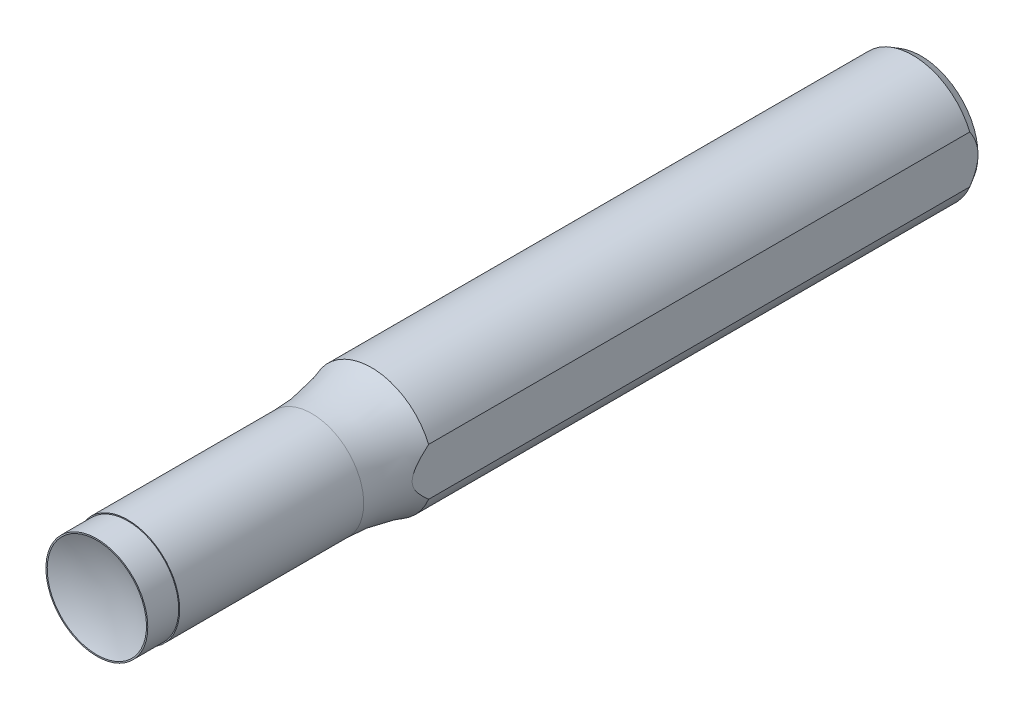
from build123d import *

# Parameters (mm, degrees)
SKETCH1_R           = 9.525
BOSS_EXTRUDE1_DEPTH = 127
SKETCH2_OUTSIDE_W   = 47.016
SKETCH2_OUTSIDE_H   = 47.016
SKETCH2_OUTSIDE_R   = 8
CUT_EXTRUDE1_DEPTH  = 42.333333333
SKETCH3_OUTSIDE_W   = 47.016
SKETCH3_OUTSIDE_H   = 47.016
SKETCH3_OUTSIDE_R   = 7.85
CUT_EXTRUDE2_DEPTH  = 4.7625
CHAMFER1_SIZE       = 1.27
CHAMFER1_SIZE2      = 0.733234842
SKETCH7_W           = 7.329526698
SKETCH7_H           = 7.329526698
CUT_EXTRUDE3_DEPTH  = 128.712377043


with BuildPart() as part:
    # Sketch1 → Boss-Extrude1 (new body)
    with BuildSketch(Plane.XY):
        Circle(SKETCH1_R)
    extrude(amount=-BOSS_EXTRUDE1_DEPTH)

    # Sketch2 outside → Cut-Extrude1 (cut)
    with BuildSketch(Plane.XY):
        Rectangle(SKETCH2_OUTSIDE_W, SKETCH2_OUTSIDE_H)
        Circle(SKETCH2_OUTSIDE_R, mode=Mode.SUBTRACT)
    extrude(amount=-CUT_EXTRUDE1_DEPTH, mode=Mode.SUBTRACT)

    # Sketch3 outside → Cut-Extrude2 (cut)
    with BuildSketch(Plane.XY):
        Rectangle(SKETCH3_OUTSIDE_W, SKETCH3_OUTSIDE_H)
        Circle(SKETCH3_OUTSIDE_R, mode=Mode.SUBTRACT)
    extrude(amount=-CUT_EXTRUDE2_DEPTH, mode=Mode.SUBTRACT)

    # Sketch4 → Cut-Revolve1 (revolve, cut)
    with BuildSketch(Plane(origin=(0, 0, 0), x_dir=(0, 0, -1), z_dir=(1, 0, 0)), mode=Mode.PRIVATE) as cut_revolve1_sk:
        with BuildLine():
            Line((0, 0), (0, 7.65))
            ThreePointArc((0, 7.65), (1.198323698, 3.908124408), (1.603510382, 0))
            Line((1.603510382, 0), (0, 0))
        make_face()
    revolve(cut_revolve1_sk.sketch.rotate(Axis((0, 0, 0), (0, 0, -1)), 180), axis=Axis((0, 0, 0), (0, 0, -1)), mode=Mode.SUBTRACT)

    # Chamfer1
    chamfer1_edges = [part.edges().sort_by_distance(p)[0] for p in [
        (-9.525, 0, -127),
    ]]
    chamfer1_side = [part.faces().sort_by_distance(p)[0] for p in [
        (-9.525, 0, -84.666666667),
    ]]
    chamfer(chamfer1_edges, length=CHAMFER1_SIZE, length2=CHAMFER1_SIZE2, reference=chamfer1_side[0])

    # Sketch5 → Revolve1 (revolve)
    with BuildSketch(Plane(origin=(0, 0, 0), x_dir=(0, 0, -1), z_dir=(1, 0, 0)), mode=Mode.PRIVATE) as revolve1_sk:
        with BuildLine():
            Line((42.333333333, 0), (33.123114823, 0))
            Line((33.123114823, 0), (33.123114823, 8))
            ThreePointArc((33.123114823, 8), (37.790923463, 8.383827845), (42.333333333, 9.525))
            Line((42.333333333, 9.525), (42.333333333, 0))
        make_face()
    revolve(revolve1_sk.sketch.rotate(Axis((0, 0, -42.333333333), (0, 0, 1)), 270), axis=Axis((0, 0, -42.333333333), (0, 0, 1)))

    # Sketch7 → Cut-Extrude3 (cut, through all)
    with BuildSketch(Plane(origin=(0, 0, -127), x_dir=(-1, 0, 0), z_dir=(0, 0, -1))):
        with Locations((-12.456528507, 0)):
            Rectangle(SKETCH7_W, SKETCH7_H)
    extrude(amount=-CUT_EXTRUDE3_DEPTH, mode=Mode.SUBTRACT)


solid = part.part
